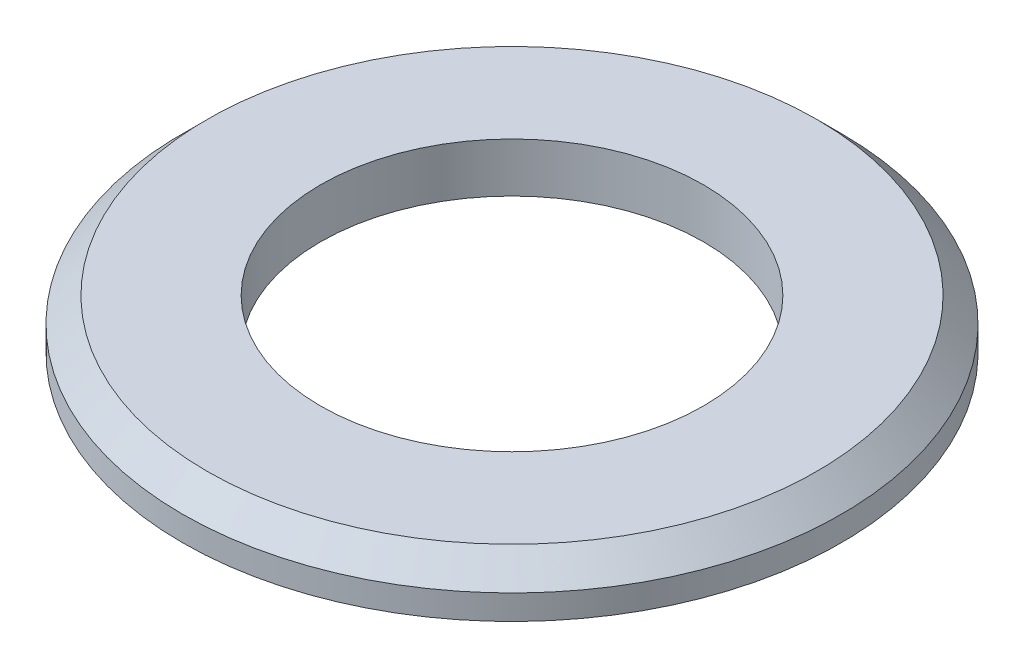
from build123d import *

# Parameters (mm, degrees)
SKETCH1_R      = 80
SKETCH1_R_2    = 46.5
EXTRUDE1_DEPTH = 12
CHAMFER1_SIZE  = 6


with BuildPart() as part:
    # Sketch1 → Extrude1 (new body)
    with BuildSketch(Plane(origin=(0, 0, 0), x_dir=(1, 0, 0), z_dir=(0, 1, 0))):
        with Locations(Location((0, 0, 0), (0, 0, 270))):
            Circle(SKETCH1_R)
        with Locations(Location((0, 0, 0), (0, 0, 270))):
            Circle(SKETCH1_R_2, mode=Mode.SUBTRACT)
    extrude(amount=EXTRUDE1_DEPTH)

    # Chamfer1
    chamfer1_edges = [part.edges().sort_by_distance(p)[0] for p in [
        (0, 12, -80),
    ]]
    chamfer(chamfer1_edges, length=CHAMFER1_SIZE)


solid = part.part
